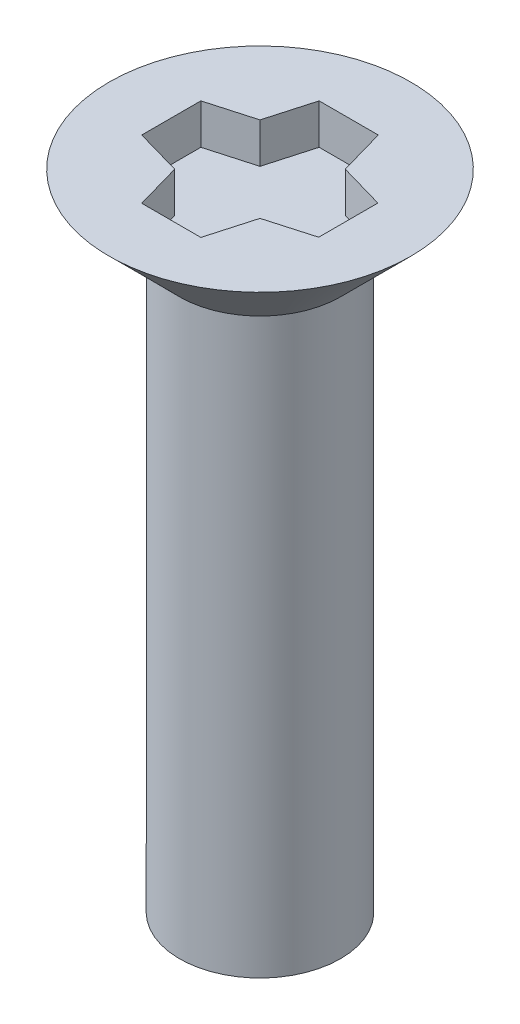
ISO-10303-21;
HEADER;
FILE_DESCRIPTION(('STEP AP214'),'2;1');
FILE_NAME('part.step','',(''),(''),'','','');
FILE_SCHEMA(('AUTOMOTIVE_DESIGN { 1 0 10303 214 1 1 1 1 }'));
ENDSEC;
DATA;
#1=APPLICATION_CONTEXT('core data for automotive mechanical design processes');
#2=APPLICATION_PROTOCOL_DEFINITION('international standard','automotive_design',2000,#1);
#3=PRODUCT_CONTEXT('',#1,'mechanical');
#4=PRODUCT('Part','Part','',(#3));
#5=PRODUCT_RELATED_PRODUCT_CATEGORY('part','',(#4));
#6=PRODUCT_DEFINITION_FORMATION('','',#4);
#7=PRODUCT_DEFINITION_CONTEXT('part definition',#1,'design');
#8=PRODUCT_DEFINITION('design','',#6,#7);
#9=PRODUCT_DEFINITION_SHAPE('','',#8);
#10=(LENGTH_UNIT() NAMED_UNIT(*) SI_UNIT(.MILLI.,.METRE.));
#11=(NAMED_UNIT(*) PLANE_ANGLE_UNIT() SI_UNIT($,.RADIAN.));
#12=(NAMED_UNIT(*) SI_UNIT($,.STERADIAN.) SOLID_ANGLE_UNIT());
#13=UNCERTAINTY_MEASURE_WITH_UNIT(LENGTH_MEASURE(1.E-05),#10,'distance_accuracy_value','');
#14=(GEOMETRIC_REPRESENTATION_CONTEXT(3) GLOBAL_UNCERTAINTY_ASSIGNED_CONTEXT((#13)) GLOBAL_UNIT_ASSIGNED_CONTEXT((#10,
#11,#12)) REPRESENTATION_CONTEXT('',''));
#15=CARTESIAN_POINT('',(0.,0.,0.));
#16=DIRECTION('',(0.,0.,1.));
#17=DIRECTION('',(1.,0.,0.));
#18=AXIS2_PLACEMENT_3D('',#15,#16,#17);
#19=CARTESIAN_POINT('',(-1.61688066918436,-0.999999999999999,0.90193343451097));
#20=DIRECTION('',(0.,1.,0.));
#21=DIRECTION('',(-1.,0.,0.));
#22=AXIS2_PLACEMENT_3D('',#19,#20,#21);
#23=PLANE('',#22);
#24=DIRECTION('',(-0.272803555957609,0.,-0.962069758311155));
#25=VECTOR('',#24,1.);
#26=CARTESIAN_POINT('',(0.735000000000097,-0.999999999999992,-2.20499999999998));
#27=LINE('',#26,#25);
#28=CARTESIAN_POINT('',(1.0596750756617,-0.999999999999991,-1.06000000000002));
#29=VERTEX_POINT('',#28);
#30=CARTESIAN_POINT('',(0.735000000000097,-0.999999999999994,-2.20499999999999));
#31=VERTEX_POINT('',#30);
#32=EDGE_CURVE('E158',#29,#31,#27,.T.);
#33=ORIENTED_EDGE('',*,*,#32,.T.);
#34=DIRECTION('',(1.,0.,0.));
#35=VECTOR('',#34,1.);
#36=CARTESIAN_POINT('',(-0.734999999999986,-0.999999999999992,-2.20499999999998));
#37=LINE('',#36,#35);
#38=CARTESIAN_POINT('',(-0.734999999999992,-0.999999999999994,-2.20499999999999));
#39=VERTEX_POINT('',#38);
#40=EDGE_CURVE('E163',#31,#39,#37,.F.);
#41=ORIENTED_EDGE('',*,*,#40,.T.);
#42=DIRECTION('',(-0.27305622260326,0.,0.961998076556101));
#43=VECTOR('',#42,1.);
#44=CARTESIAN_POINT('',(-1.06000000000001,-0.99999999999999,-1.06000000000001));
#45=LINE('',#44,#43);
#46=CARTESIAN_POINT('',(-1.06,-0.999999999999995,-1.06));
#47=VERTEX_POINT('',#46);
#48=EDGE_CURVE('E168',#39,#47,#45,.T.);
#49=ORIENTED_EDGE('',*,*,#48,.T.);
#50=DIRECTION('',(-0.961998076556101,0.,0.27305622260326));
#51=VECTOR('',#50,1.);
#52=CARTESIAN_POINT('',(-2.20499999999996,-0.999999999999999,-0.734999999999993));
#53=LINE('',#52,#51);
#54=CARTESIAN_POINT('',(-2.20499999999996,-0.999999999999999,-0.734999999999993));
#55=VERTEX_POINT('',#54);
#56=EDGE_CURVE('E109',#47,#55,#53,.T.);
#57=ORIENTED_EDGE('',*,*,#56,.T.);
#58=DIRECTION('',(0.,0.,1.));
#59=VECTOR('',#58,1.);
#60=CARTESIAN_POINT('',(-2.20499999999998,-0.999999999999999,0.734999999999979));
#61=LINE('',#60,#59);
#62=CARTESIAN_POINT('',(-2.20499999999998,-0.999999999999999,0.734999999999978));
#63=VERTEX_POINT('',#62);
#64=EDGE_CURVE('E106',#55,#63,#61,.T.);
#65=ORIENTED_EDGE('',*,*,#64,.T.);
#66=DIRECTION('',(0.961998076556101,0.,0.273056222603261));
#67=VECTOR('',#66,1.);
#68=CARTESIAN_POINT('',(-1.05999999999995,-0.999999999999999,1.05999999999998));
#69=LINE('',#68,#67);
#70=CARTESIAN_POINT('',(-1.05999999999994,-0.999999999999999,1.05999999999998));
#71=VERTEX_POINT('',#70);
#72=EDGE_CURVE('E103',#63,#71,#69,.T.);
#73=ORIENTED_EDGE('',*,*,#72,.T.);
#74=DIRECTION('',(0.273056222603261,0.,0.961998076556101));
#75=VECTOR('',#74,1.);
#76=CARTESIAN_POINT('',(-0.73499999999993,-0.999999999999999,2.20499999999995));
#77=LINE('',#76,#75);
#78=CARTESIAN_POINT('',(-0.73499999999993,-0.999999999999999,2.20499999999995));
#79=VERTEX_POINT('',#78);
#80=EDGE_CURVE('E126',#71,#79,#77,.T.);
#81=ORIENTED_EDGE('',*,*,#80,.T.);
#82=DIRECTION('',(1.,0.,0.));
#83=VECTOR('',#82,1.);
#84=CARTESIAN_POINT('',(0.735000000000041,-0.999999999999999,2.20499999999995));
#85=LINE('',#84,#83);
#86=CARTESIAN_POINT('',(0.735000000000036,-0.999999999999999,2.20499999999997));
#87=VERTEX_POINT('',#86);
#88=EDGE_CURVE('E133',#79,#87,#85,.T.);
#89=ORIENTED_EDGE('',*,*,#88,.T.);
#90=DIRECTION('',(0.272803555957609,0.,-0.962069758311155));
#91=VECTOR('',#90,1.);
#92=CARTESIAN_POINT('',(1.05967507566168,-0.999999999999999,1.05999999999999));
#93=LINE('',#92,#91);
#94=CARTESIAN_POINT('',(1.05967507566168,-0.999999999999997,1.05999999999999));
#95=VERTEX_POINT('',#94);
#96=EDGE_CURVE('E138',#87,#95,#93,.T.);
#97=ORIENTED_EDGE('',*,*,#96,.T.);
#98=DIRECTION('',(0.961384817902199,0.,-0.275207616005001));
#99=VECTOR('',#98,1.);
#100=CARTESIAN_POINT('',(2.195,-0.999999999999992,0.735000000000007));
#101=LINE('',#100,#99);
#102=CARTESIAN_POINT('',(2.195,-0.999999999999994,0.735000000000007));
#103=VERTEX_POINT('',#102);
#104=EDGE_CURVE('E143',#95,#103,#101,.T.);
#105=ORIENTED_EDGE('',*,*,#104,.T.);
#106=DIRECTION('',(0.,0.,1.));
#107=VECTOR('',#106,1.);
#108=CARTESIAN_POINT('',(2.195,-0.999999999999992,-0.735000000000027));
#109=LINE('',#108,#107);
#110=CARTESIAN_POINT('',(2.195,-0.999999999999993,-0.735000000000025));
#111=VERTEX_POINT('',#110);
#112=EDGE_CURVE('E148',#103,#111,#109,.F.);
#113=ORIENTED_EDGE('',*,*,#112,.T.);
#114=DIRECTION('',(-0.961384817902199,0.,-0.275207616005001));
#115=VECTOR('',#114,1.);
#116=CARTESIAN_POINT('',(1.05967507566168,-0.999999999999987,-1.06000000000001));
#117=LINE('',#116,#115);
#118=EDGE_CURVE('E153',#111,#29,#117,.T.);
#119=ORIENTED_EDGE('',*,*,#118,.T.);
#120=EDGE_LOOP('',(#33,#41,#49,#57,#65,#73,#81,#89,#97,#105,#113,#119));
#121=FACE_BOUND('',#120,.T.);
#122=ADVANCED_FACE('F17',(#121),#23,.T.);
#123=CARTESIAN_POINT('',(-2.20499999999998,-0.999999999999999,0.734999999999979));
#124=DIRECTION('',(-1.,0.,0.));
#125=DIRECTION('',(0.,-1.,0.));
#126=AXIS2_PLACEMENT_3D('',#123,#124,#125);
#127=PLANE('',#126);
#128=DIRECTION('',(0.,1.,0.));
#129=VECTOR('',#128,1.);
#130=CARTESIAN_POINT('',(-2.20499999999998,-0.999999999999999,0.734999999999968));
#131=LINE('',#130,#129);
#132=CARTESIAN_POINT('',(-2.20499999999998,0.,0.734999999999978));
#133=VERTEX_POINT('',#132);
#134=EDGE_CURVE('E112',#133,#63,#131,.F.);
#135=ORIENTED_EDGE('',*,*,#134,.T.);
#136=ORIENTED_EDGE('',*,*,#64,.F.);
#137=DIRECTION('',(0.,1.,0.));
#138=VECTOR('',#137,1.);
#139=CARTESIAN_POINT('',(-2.20499999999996,-0.999999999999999,-0.734999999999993));
#140=LINE('',#139,#138);
#141=CARTESIAN_POINT('',(-2.20499999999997,0.,-0.734999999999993));
#142=VERTEX_POINT('',#141);
#143=EDGE_CURVE('E173',#55,#142,#140,.T.);
#144=ORIENTED_EDGE('',*,*,#143,.T.);
#145=DIRECTION('',(0.,0.,1.));
#146=VECTOR('',#145,1.);
#147=CARTESIAN_POINT('',(-2.20499999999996,0.,0.));
#148=LINE('',#147,#146);
#149=EDGE_CURVE('E117',#142,#133,#148,.T.);
#150=ORIENTED_EDGE('',*,*,#149,.T.);
#151=EDGE_LOOP('',(#135,#136,#144,#150));
#152=FACE_BOUND('',#151,.T.);
#153=ADVANCED_FACE('F115',(#152),#127,.F.);
#154=CARTESIAN_POINT('',(-1.05999999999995,-0.999999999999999,1.05999999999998));
#155=DIRECTION('',(-0.273056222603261,0.,0.961998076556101));
#156=DIRECTION('',(0.961998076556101,0.,0.273056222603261));
#157=AXIS2_PLACEMENT_3D('',#154,#155,#156);
#158=PLANE('',#157);
#159=DIRECTION('',(0.,1.,0.));
#160=VECTOR('',#159,1.);
#161=CARTESIAN_POINT('',(-1.05999999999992,-0.999999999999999,1.05999999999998));
#162=LINE('',#161,#160);
#163=CARTESIAN_POINT('',(-1.05999999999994,0.,1.05999999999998));
#164=VERTEX_POINT('',#163);
#165=EDGE_CURVE('E123',#164,#71,#162,.F.);
#166=ORIENTED_EDGE('',*,*,#165,.T.);
#167=ORIENTED_EDGE('',*,*,#72,.F.);
#168=ORIENTED_EDGE('',*,*,#134,.F.);
#169=DIRECTION('',(0.961998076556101,0.,0.273056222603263));
#170=VECTOR('',#169,1.);
#171=CARTESIAN_POINT('',(-2.20499999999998,0.,0.734999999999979));
#172=LINE('',#171,#170);
#173=EDGE_CURVE('E176',#133,#164,#172,.T.);
#174=ORIENTED_EDGE('',*,*,#173,.T.);
#175=EDGE_LOOP('',(#166,#167,#168,#174));
#176=FACE_BOUND('',#175,.T.);
#177=ADVANCED_FACE('F121',(#176),#158,.F.);
#178=CARTESIAN_POINT('',(-0.73499999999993,-0.999999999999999,2.20499999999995));
#179=DIRECTION('',(-0.961998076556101,0.,0.273056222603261));
#180=DIRECTION('',(0.273056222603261,0.,0.961998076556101));
#181=AXIS2_PLACEMENT_3D('',#178,#179,#180);
#182=PLANE('',#181);
#183=DIRECTION('',(0.,-1.,0.));
#184=VECTOR('',#183,1.);
#185=CARTESIAN_POINT('',(-0.73499999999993,-0.999999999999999,2.20499999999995));
#186=LINE('',#185,#184);
#187=CARTESIAN_POINT('',(-0.73499999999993,0.,2.20499999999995));
#188=VERTEX_POINT('',#187);
#189=EDGE_CURVE('E130',#188,#79,#186,.T.);
#190=ORIENTED_EDGE('',*,*,#189,.T.);
#191=ORIENTED_EDGE('',*,*,#80,.F.);
#192=ORIENTED_EDGE('',*,*,#165,.F.);
#193=DIRECTION('',(0.273056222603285,0.,0.961998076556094));
#194=VECTOR('',#193,1.);
#195=CARTESIAN_POINT('',(-1.05999999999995,0.,1.05999999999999));
#196=LINE('',#195,#194);
#197=EDGE_CURVE('E178',#164,#188,#196,.T.);
#198=ORIENTED_EDGE('',*,*,#197,.T.);
#199=EDGE_LOOP('',(#190,#191,#192,#198));
#200=FACE_BOUND('',#199,.T.);
#201=ADVANCED_FACE('F253',(#200),#182,.F.);
#202=CARTESIAN_POINT('',(0.735000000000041,-0.999999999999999,2.20499999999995));
#203=DIRECTION('',(0.,0.,1.));
#204=DIRECTION('',(0.,-1.,0.));
#205=AXIS2_PLACEMENT_3D('',#202,#203,#204);
#206=PLANE('',#205);
#207=DIRECTION('',(0.,1.,0.));
#208=VECTOR('',#207,1.);
#209=CARTESIAN_POINT('',(0.735000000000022,-0.999999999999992,2.20500000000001));
#210=LINE('',#209,#208);
#211=CARTESIAN_POINT('',(0.735000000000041,0.,2.20499999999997));
#212=VERTEX_POINT('',#211);
#213=EDGE_CURVE('E135',#212,#87,#210,.F.);
#214=ORIENTED_EDGE('',*,*,#213,.T.);
#215=ORIENTED_EDGE('',*,*,#88,.F.);
#216=ORIENTED_EDGE('',*,*,#189,.F.);
#217=DIRECTION('',(1.,0.,0.));
#218=VECTOR('',#217,1.);
#219=CARTESIAN_POINT('',(0.,0.,2.20499999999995));
#220=LINE('',#219,#218);
#221=EDGE_CURVE('E180',#188,#212,#220,.T.);
#222=ORIENTED_EDGE('',*,*,#221,.T.);
#223=EDGE_LOOP('',(#214,#215,#216,#222));
#224=FACE_BOUND('',#223,.T.);
#225=ADVANCED_FACE('F250',(#224),#206,.F.);
#226=CARTESIAN_POINT('',(1.05967507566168,-0.999999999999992,1.05999999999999));
#227=DIRECTION('',(0.962069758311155,0.,0.272803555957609));
#228=DIRECTION('',(0.272803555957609,0.,-0.962069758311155));
#229=AXIS2_PLACEMENT_3D('',#226,#227,#228);
#230=PLANE('',#229);
#231=DIRECTION('',(0.,1.,0.));
#232=VECTOR('',#231,1.);
#233=CARTESIAN_POINT('',(1.05967507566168,-0.999999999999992,1.06));
#234=LINE('',#233,#232);
#235=CARTESIAN_POINT('',(1.05967507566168,0.,1.05999999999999));
#236=VERTEX_POINT('',#235);
#237=EDGE_CURVE('E140',#236,#95,#234,.F.);
#238=ORIENTED_EDGE('',*,*,#237,.T.);
#239=ORIENTED_EDGE('',*,*,#96,.F.);
#240=ORIENTED_EDGE('',*,*,#213,.F.);
#241=DIRECTION('',(0.272803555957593,0.,-0.962069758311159));
#242=VECTOR('',#241,1.);
#243=CARTESIAN_POINT('',(0.735000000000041,0.,2.20500000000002));
#244=LINE('',#243,#242);
#245=EDGE_CURVE('E182',#212,#236,#244,.T.);
#246=ORIENTED_EDGE('',*,*,#245,.T.);
#247=EDGE_LOOP('',(#238,#239,#240,#246));
#248=FACE_BOUND('',#247,.T.);
#249=ADVANCED_FACE('F246',(#248),#230,.F.);
#250=CARTESIAN_POINT('',(2.195,-0.999999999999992,0.735000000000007));
#251=DIRECTION('',(0.275207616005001,0.,0.961384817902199));
#252=DIRECTION('',(0.961384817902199,0.,-0.275207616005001));
#253=AXIS2_PLACEMENT_3D('',#250,#251,#252);
#254=PLANE('',#253);
#255=DIRECTION('',(0.,1.,0.));
#256=VECTOR('',#255,1.);
#257=CARTESIAN_POINT('',(2.195,-0.999999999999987,0.735000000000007));
#258=LINE('',#257,#256);
#259=CARTESIAN_POINT('',(2.195,0.,0.735000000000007));
#260=VERTEX_POINT('',#259);
#261=EDGE_CURVE('E145',#260,#103,#258,.F.);
#262=ORIENTED_EDGE('',*,*,#261,.T.);
#263=ORIENTED_EDGE('',*,*,#104,.F.);
#264=ORIENTED_EDGE('',*,*,#237,.F.);
#265=DIRECTION('',(0.9613848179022,0.,-0.275207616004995));
#266=VECTOR('',#265,1.);
#267=CARTESIAN_POINT('',(1.05967507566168,0.,1.05999999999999));
#268=LINE('',#267,#266);
#269=EDGE_CURVE('E184',#236,#260,#268,.T.);
#270=ORIENTED_EDGE('',*,*,#269,.T.);
#271=EDGE_LOOP('',(#262,#263,#264,#270));
#272=FACE_BOUND('',#271,.T.);
#273=ADVANCED_FACE('F239',(#272),#254,.F.);
#274=CARTESIAN_POINT('',(2.195,-0.999999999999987,-0.735000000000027));
#275=DIRECTION('',(1.,0.,0.));
#276=DIRECTION('',(0.,1.,0.));
#277=AXIS2_PLACEMENT_3D('',#274,#275,#276);
#278=PLANE('',#277);
#279=DIRECTION('',(0.,1.,0.));
#280=VECTOR('',#279,1.);
#281=CARTESIAN_POINT('',(2.195,-0.999999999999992,-0.73500000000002));
#282=LINE('',#281,#280);
#283=CARTESIAN_POINT('',(2.195,0.,-0.735000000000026));
#284=VERTEX_POINT('',#283);
#285=EDGE_CURVE('E150',#284,#111,#282,.F.);
#286=ORIENTED_EDGE('',*,*,#285,.T.);
#287=ORIENTED_EDGE('',*,*,#112,.F.);
#288=ORIENTED_EDGE('',*,*,#261,.F.);
#289=DIRECTION('',(0.,0.,1.));
#290=VECTOR('',#289,1.);
#291=CARTESIAN_POINT('',(2.195,0.,0.));
#292=LINE('',#291,#290);
#293=EDGE_CURVE('E186',#260,#284,#292,.F.);
#294=ORIENTED_EDGE('',*,*,#293,.T.);
#295=EDGE_LOOP('',(#286,#287,#288,#294));
#296=FACE_BOUND('',#295,.T.);
#297=ADVANCED_FACE('F235',(#296),#278,.F.);
#298=CARTESIAN_POINT('',(1.05967507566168,-0.999999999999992,-1.06000000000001));
#299=DIRECTION('',(0.275207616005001,0.,-0.961384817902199));
#300=DIRECTION('',(-0.961384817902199,0.,-0.275207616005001));
#301=AXIS2_PLACEMENT_3D('',#298,#299,#300);
#302=PLANE('',#301);
#303=DIRECTION('',(0.,1.,0.));
#304=VECTOR('',#303,1.);
#305=CARTESIAN_POINT('',(1.05967507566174,-0.999999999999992,-1.06000000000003));
#306=LINE('',#305,#304);
#307=CARTESIAN_POINT('',(1.0596750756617,0.,-1.06000000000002));
#308=VERTEX_POINT('',#307);
#309=EDGE_CURVE('E155',#308,#29,#306,.F.);
#310=ORIENTED_EDGE('',*,*,#309,.T.);
#311=ORIENTED_EDGE('',*,*,#118,.F.);
#312=ORIENTED_EDGE('',*,*,#285,.F.);
#313=DIRECTION('',(-0.9613848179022,0.,-0.275207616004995));
#314=VECTOR('',#313,1.);
#315=CARTESIAN_POINT('',(2.195,0.,-0.735000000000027));
#316=LINE('',#315,#314);
#317=EDGE_CURVE('E188',#284,#308,#316,.T.);
#318=ORIENTED_EDGE('',*,*,#317,.T.);
#319=EDGE_LOOP('',(#310,#311,#312,#318));
#320=FACE_BOUND('',#319,.T.);
#321=ADVANCED_FACE('F231',(#320),#302,.F.);
#322=CARTESIAN_POINT('',(0.735000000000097,-0.999999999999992,-2.20499999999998));
#323=DIRECTION('',(0.962069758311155,0.,-0.272803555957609));
#324=DIRECTION('',(-0.272803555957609,0.,-0.962069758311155));
#325=AXIS2_PLACEMENT_3D('',#322,#323,#324);
#326=PLANE('',#325);
#327=DIRECTION('',(0.,1.,0.));
#328=VECTOR('',#327,1.);
#329=CARTESIAN_POINT('',(0.735000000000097,-0.99999999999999,-2.20499999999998));
#330=LINE('',#329,#328);
#331=CARTESIAN_POINT('',(0.735000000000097,0.,-2.20499999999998));
#332=VERTEX_POINT('',#331);
#333=EDGE_CURVE('E160',#332,#31,#330,.F.);
#334=ORIENTED_EDGE('',*,*,#333,.T.);
#335=ORIENTED_EDGE('',*,*,#32,.F.);
#336=ORIENTED_EDGE('',*,*,#309,.F.);
#337=DIRECTION('',(-0.272803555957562,0.,-0.962069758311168));
#338=VECTOR('',#337,1.);
#339=CARTESIAN_POINT('',(1.05967507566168,0.,-1.06000000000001));
#340=LINE('',#339,#338);
#341=EDGE_CURVE('E190',#308,#332,#340,.T.);
#342=ORIENTED_EDGE('',*,*,#341,.T.);
#343=EDGE_LOOP('',(#334,#335,#336,#342));
#344=FACE_BOUND('',#343,.T.);
#345=ADVANCED_FACE('F224',(#344),#326,.F.);
#346=CARTESIAN_POINT('',(-0.734999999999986,-0.99999999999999,-2.20499999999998));
#347=DIRECTION('',(0.,0.,-1.));
#348=DIRECTION('',(0.,1.,0.));
#349=AXIS2_PLACEMENT_3D('',#346,#347,#348);
#350=PLANE('',#349);
#351=DIRECTION('',(0.,1.,0.));
#352=VECTOR('',#351,1.);
#353=CARTESIAN_POINT('',(-0.735000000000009,-0.999999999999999,-2.20499999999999));
#354=LINE('',#353,#352);
#355=CARTESIAN_POINT('',(-0.734999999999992,0.,-2.20499999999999));
#356=VERTEX_POINT('',#355);
#357=EDGE_CURVE('E165',#356,#39,#354,.F.);
#358=ORIENTED_EDGE('',*,*,#357,.T.);
#359=ORIENTED_EDGE('',*,*,#40,.F.);
#360=ORIENTED_EDGE('',*,*,#333,.F.);
#361=DIRECTION('',(1.,0.,0.));
#362=VECTOR('',#361,1.);
#363=CARTESIAN_POINT('',(0.,0.,-2.20499999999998));
#364=LINE('',#363,#362);
#365=EDGE_CURVE('E192',#332,#356,#364,.F.);
#366=ORIENTED_EDGE('',*,*,#365,.T.);
#367=EDGE_LOOP('',(#358,#359,#360,#366));
#368=FACE_BOUND('',#367,.T.);
#369=ADVANCED_FACE('F222',(#368),#350,.F.);
#370=CARTESIAN_POINT('',(-1.06000000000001,-0.999999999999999,-1.06000000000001));
#371=DIRECTION('',(-0.961998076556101,0.,-0.27305622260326));
#372=DIRECTION('',(-0.27305622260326,0.,0.961998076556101));
#373=AXIS2_PLACEMENT_3D('',#370,#371,#372);
#374=PLANE('',#373);
#375=DIRECTION('',(0.,1.,0.));
#376=VECTOR('',#375,1.);
#377=CARTESIAN_POINT('',(-1.06,-0.999999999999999,-1.05999999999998));
#378=LINE('',#377,#376);
#379=CARTESIAN_POINT('',(-1.06,0.,-1.06));
#380=VERTEX_POINT('',#379);
#381=EDGE_CURVE('E170',#380,#47,#378,.F.);
#382=ORIENTED_EDGE('',*,*,#381,.T.);
#383=ORIENTED_EDGE('',*,*,#48,.F.);
#384=ORIENTED_EDGE('',*,*,#357,.F.);
#385=DIRECTION('',(-0.27305622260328,0.,0.961998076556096));
#386=VECTOR('',#385,1.);
#387=CARTESIAN_POINT('',(-0.734999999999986,0.,-2.20499999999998));
#388=LINE('',#387,#386);
#389=EDGE_CURVE('E34',#356,#380,#388,.T.);
#390=ORIENTED_EDGE('',*,*,#389,.T.);
#391=EDGE_LOOP('',(#382,#383,#384,#390));
#392=FACE_BOUND('',#391,.T.);
#393=ADVANCED_FACE('F217',(#392),#374,.F.);
#394=CARTESIAN_POINT('',(-2.20499999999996,-0.999999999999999,-0.734999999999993));
#395=DIRECTION('',(-0.27305622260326,0.,-0.961998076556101));
#396=DIRECTION('',(-0.961998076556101,0.,0.27305622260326));
#397=AXIS2_PLACEMENT_3D('',#394,#395,#396);
#398=PLANE('',#397);
#399=ORIENTED_EDGE('',*,*,#143,.F.);
#400=ORIENTED_EDGE('',*,*,#56,.F.);
#401=ORIENTED_EDGE('',*,*,#381,.F.);
#402=DIRECTION('',(-0.961998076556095,0.,0.273056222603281));
#403=VECTOR('',#402,1.);
#404=CARTESIAN_POINT('',(-1.06000000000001,0.,-1.06000000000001));
#405=LINE('',#404,#403);
#406=EDGE_CURVE('E195',#380,#142,#405,.T.);
#407=ORIENTED_EDGE('',*,*,#406,.T.);
#408=EDGE_LOOP('',(#399,#400,#401,#407));
#409=FACE_BOUND('',#408,.T.);
#410=ADVANCED_FACE('F210',(#409),#398,.F.);
#411=CARTESIAN_POINT('',(0.,0.,0.));
#412=DIRECTION('',(0.,-1.,0.));
#413=DIRECTION('',(1.,0.,0.));
#414=AXIS2_PLACEMENT_3D('',#411,#412,#413);
#415=PLANE('',#414);
#416=CARTESIAN_POINT('',(0.,-5.6843418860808E-11,0.));
#417=DIRECTION('',(0.,1.,0.));
#418=DIRECTION('',(-1.,0.,0.));
#419=AXIS2_PLACEMENT_3D('',#416,#417,#418);
#420=CIRCLE('',#419,3.75000000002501);
#421=CARTESIAN_POINT('',(-3.75000000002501,-5.68434188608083E-11,0.));
#422=VERTEX_POINT('',#421);
#423=EDGE_CURVE('E20',#422,#422,#420,.F.);
#424=ORIENTED_EDGE('',*,*,#423,.F.);
#425=EDGE_LOOP('',(#424));
#426=FACE_BOUND('',#425,.T.);
#427=ORIENTED_EDGE('',*,*,#389,.F.);
#428=ORIENTED_EDGE('',*,*,#365,.F.);
#429=ORIENTED_EDGE('',*,*,#341,.F.);
#430=ORIENTED_EDGE('',*,*,#317,.F.);
#431=ORIENTED_EDGE('',*,*,#293,.F.);
#432=ORIENTED_EDGE('',*,*,#269,.F.);
#433=ORIENTED_EDGE('',*,*,#245,.F.);
#434=ORIENTED_EDGE('',*,*,#221,.F.);
#435=ORIENTED_EDGE('',*,*,#197,.F.);
#436=ORIENTED_EDGE('',*,*,#173,.F.);
#437=ORIENTED_EDGE('',*,*,#149,.F.);
#438=ORIENTED_EDGE('',*,*,#406,.F.);
#439=EDGE_LOOP('',(#427,#428,#429,#430,#431,#432,#433,#434,#435,#436,#437,#438));
#440=FACE_BOUND('',#439,.T.);
#441=ADVANCED_FACE('F207',(#426,#440),#415,.F.);
#442=CARTESIAN_POINT('',(0.,-1.13686837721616E-10,0.));
#443=DIRECTION('',(0.,1.,0.));
#444=DIRECTION('',(-1.,0.,0.));
#445=AXIS2_PLACEMENT_3D('',#442,#443,#444);
#446=CONICAL_SURFACE('',#445,3.74999999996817,0.785398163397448);
#447=ORIENTED_EDGE('',*,*,#423,.T.);
#448=EDGE_LOOP('',(#447));
#449=FACE_BOUND('',#448,.T.);
#450=CARTESIAN_POINT('',(0.,-1.74999999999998,0.));
#451=DIRECTION('',(0.,-1.,0.));
#452=DIRECTION('',(1.,0.,0.));
#453=AXIS2_PLACEMENT_3D('',#450,#451,#452);
#454=CIRCLE('',#453,2.);
#455=CARTESIAN_POINT('',(2.,-1.74999999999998,0.));
#456=VERTEX_POINT('',#455);
#457=EDGE_CURVE('E26',#456,#456,#454,.T.);
#458=ORIENTED_EDGE('',*,*,#457,.F.);
#459=EDGE_LOOP('',(#458));
#460=FACE_BOUND('',#459,.T.);
#461=ADVANCED_FACE('F204',(#449,#460),#446,.T.);
#462=CARTESIAN_POINT('',(-2.,-16.,0.));
#463=DIRECTION('',(0.,1.,0.));
#464=DIRECTION('',(-1.,0.,0.));
#465=AXIS2_PLACEMENT_3D('',#462,#463,#464);
#466=PLANE('',#465);
#467=CARTESIAN_POINT('',(0.,-16.,0.));
#468=DIRECTION('',(0.,-1.,0.));
#469=DIRECTION('',(1.,0.,0.));
#470=AXIS2_PLACEMENT_3D('',#467,#468,#469);
#471=CIRCLE('',#470,2.);
#472=CARTESIAN_POINT('',(2.,-16.,0.));
#473=VERTEX_POINT('',#472);
#474=EDGE_CURVE('E11',#473,#473,#471,.F.);
#475=ORIENTED_EDGE('',*,*,#474,.F.);
#476=EDGE_LOOP('',(#475));
#477=FACE_BOUND('',#476,.T.);
#478=ADVANCED_FACE('F265',(#477),#466,.F.);
#479=CARTESIAN_POINT('',(0.,0.,0.));
#480=DIRECTION('',(0.,-1.,0.));
#481=DIRECTION('',(1.,0.,0.));
#482=AXIS2_PLACEMENT_3D('',#479,#480,#481);
#483=CYLINDRICAL_SURFACE('',#482,2.);
#484=ORIENTED_EDGE('',*,*,#474,.T.);
#485=EDGE_LOOP('',(#484));
#486=FACE_BOUND('',#485,.T.);
#487=ORIENTED_EDGE('',*,*,#457,.T.);
#488=EDGE_LOOP('',(#487));
#489=FACE_BOUND('',#488,.T.);
#490=ADVANCED_FACE('F263',(#486,#489),#483,.T.);
#491=CLOSED_SHELL('',(#122,#153,#177,#201,#225,#249,#273,#297,#321,#345,#369,#393,#410,#441,
#461,#478,#490));
#492=MANIFOLD_SOLID_BREP('B1',#491);
#493=ADVANCED_BREP_SHAPE_REPRESENTATION('',(#18,#492),#14);
#494=SHAPE_DEFINITION_REPRESENTATION(#9,#493);
ENDSEC;
END-ISO-10303-21;
